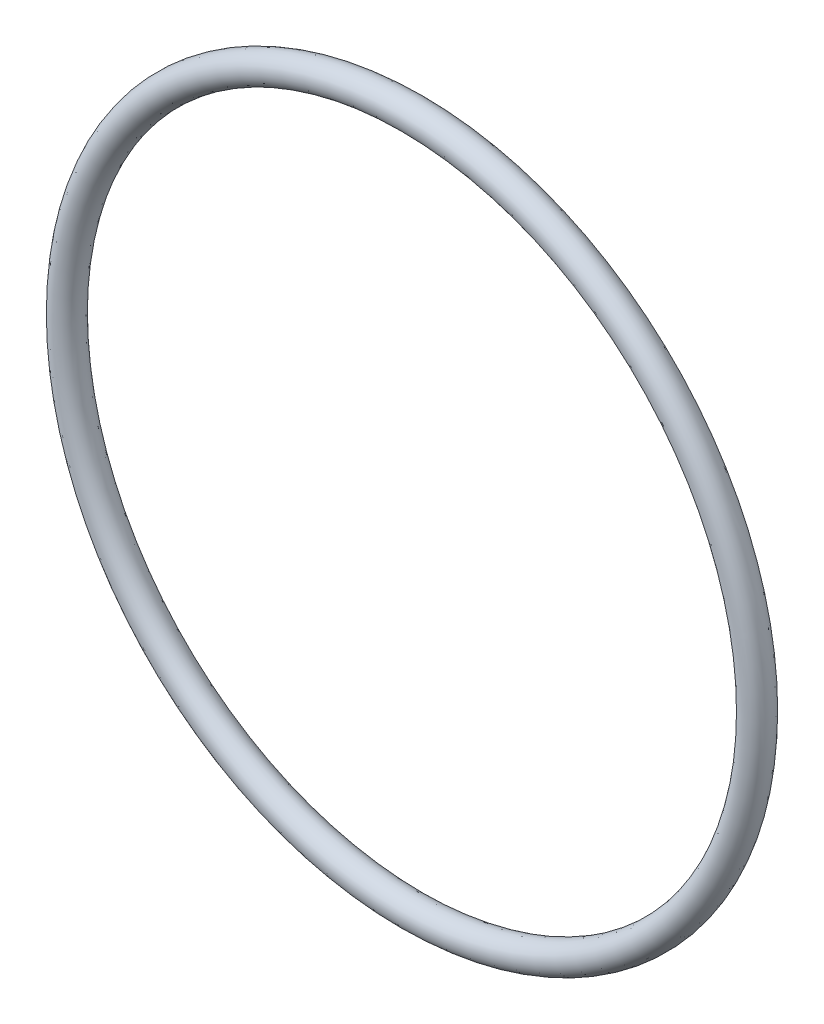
from build123d import *

# Parameters (mm, degrees)
ESQUISSE1_RX = 3.495
ESQUISSE1_RY = 3.475


with BuildPart() as part:
    # Esquisse1 → Base-R_volution (revolve)
    with BuildSketch(Plane(origin=(0, 0, 0), x_dir=(0, 0, -1), z_dir=(1, 0, 0))):
        with Locations((3.495, 82.525)):
            Ellipse(ESQUISSE1_RX, ESQUISSE1_RY)
    revolve(axis=Axis((0, 0, 0), (0, 0, -1)))


solid = part.part
